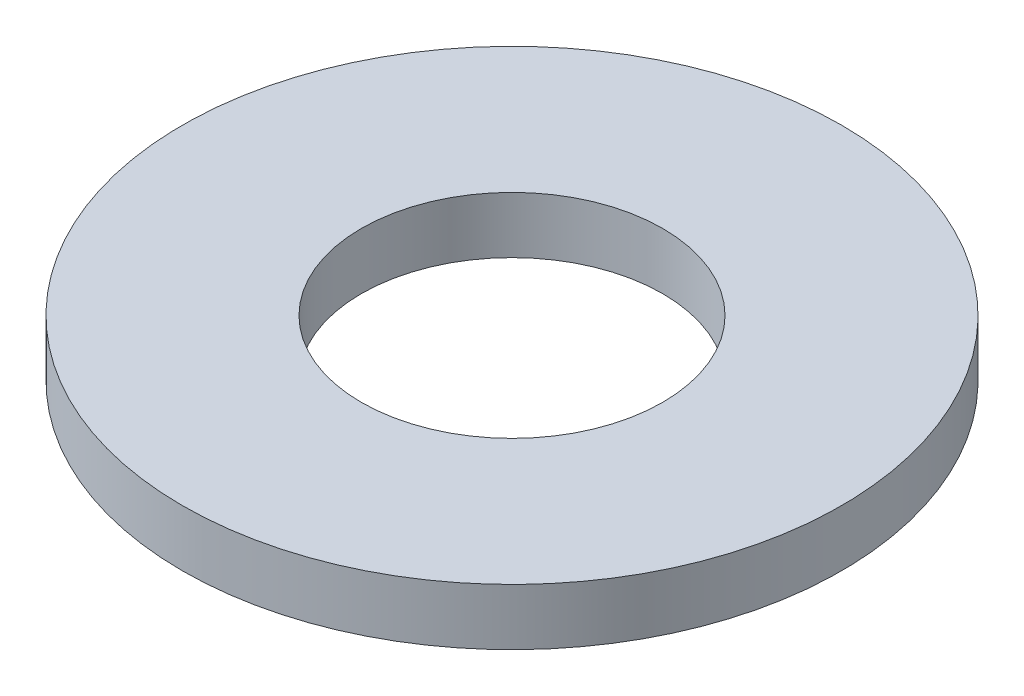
from build123d import *

# Parameters (mm, degrees)
ESQUISSE1_W = 3.8
ESQUISSE1_H = 1.2


with BuildPart() as part:
    # Esquisse1 → Base (revolve)
    with BuildSketch(Plane.XY, mode=Mode.PRIVATE) as base_sk:
        with Locations((5.1, 0.6)):
            Rectangle(ESQUISSE1_W, ESQUISSE1_H)
    revolve(base_sk.sketch.rotate(Axis((0, 0, 0), (0, 1, 0)), 90), axis=Axis((0, 0, 0), (0, 1, 0)))


solid = part.part
